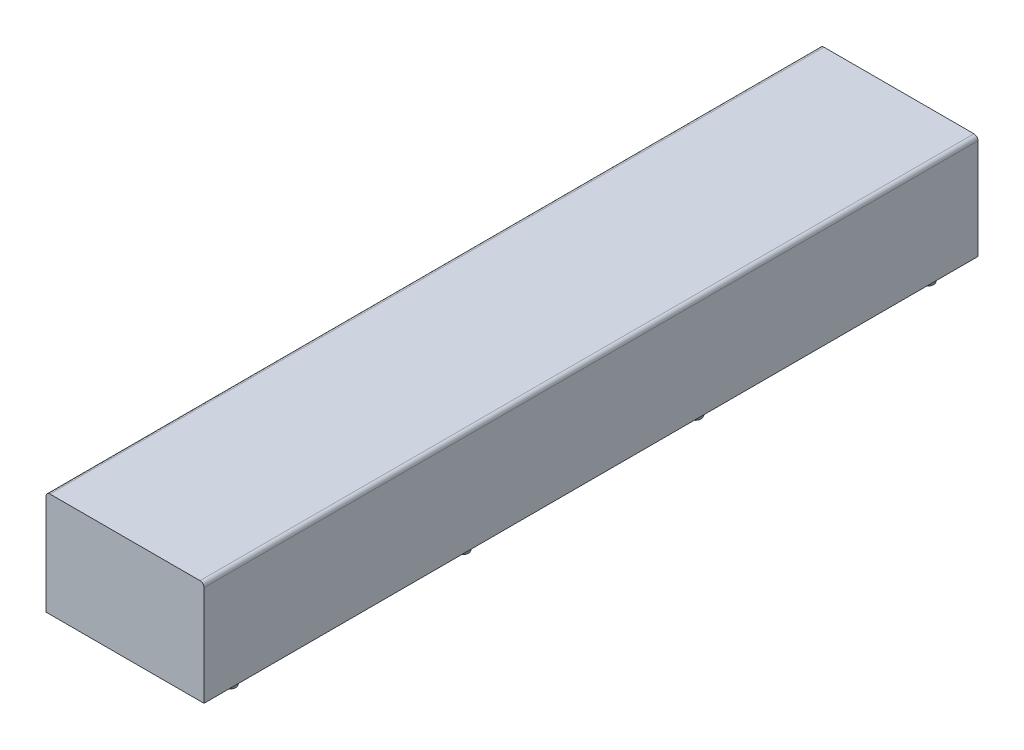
from build123d import *

# Parameters (mm, degrees)
EXTRUSION1_DEPTH           = 120
EXTRUSION1_DEPTH_BACK      = 845
ESQUISSE2_R                = 10
EXTRUSION2_DEPTH           = 10
EXTRUSION2_DRAFT           = 20
EXTRUSION2_PROFILE_2_DEPTH = 10
EXTRUSION2_PROFILE_2_DRAFT = 20
EXTRUSION2_PROFILE_3_DEPTH = 10
EXTRUSION2_PROFILE_3_DRAFT = 20
EXTRUSION2_PROFILE_4_DEPTH = 10
EXTRUSION2_PROFILE_4_DRAFT = 20
EXTRUSION2_PROFILE_5_DEPTH = 10
EXTRUSION2_PROFILE_5_DRAFT = 20
EXTRUSION2_PROFILE_6_DEPTH = 10
EXTRUSION2_PROFILE_6_DRAFT = 20
EXTRUSION2_PROFILE_7_DEPTH = 10
EXTRUSION2_PROFILE_7_DRAFT = 20
EXTRUSION2_PROFILE_8_DEPTH = 10
EXTRUSION2_PROFILE_8_DRAFT = 20


with BuildPart() as part:
    # Esquisse1 → Extrusion1 (new, two sides: drawn at the far end of the back side and taken through both)
    with BuildSketch(Plane.XY.offset(-EXTRUSION1_DEPTH_BACK)):
        with BuildLine():
            Line((-93.5, 0), (93.5, 0))
            ThreePointArc((93.5, 0), (97.035533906, -1.464466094), (98.5, -5))
            Line((98.5, -5), (98.5, -130))
            Line((98.5, -130), (-98.5, -130))
            Line((-98.5, -130), (-98.5, -5))
            ThreePointArc((-98.5, -5), (-97.035533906, -1.464466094), (-93.5, 0))
        make_face()
    extrude(amount=EXTRUSION1_DEPTH + EXTRUSION1_DEPTH_BACK)


with BuildPart() as body_2:
    # Esquisse2 → Extrusion2 (with draft: the straight prism first)
    with BuildSketch(Plane.XZ.offset(130)):
        with Locations((85, -796.817862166)):
            Circle(ESQUISSE2_R)
    extrude(amount=EXTRUSION2_DEPTH)
    # Extrusion2: the draft: its side faces are tilted about the plane it starts from
    extrusion2_sides = [body_2.faces().sort_by_distance(p)[0] for p in [
        (75, -135, -796.817862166),
    ]]
    draft(extrusion2_sides, Plane.XZ.offset(130), EXTRUSION2_DRAFT)


with BuildPart() as body_3:
    # Esquisse2 → Extrusion2 profile 2 (with draft: the straight prism first)
    with BuildSketch(Plane.XZ.offset(130)):
        with Locations((-85, -796.817862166)):
            Circle(ESQUISSE2_R)
    extrude(amount=EXTRUSION2_PROFILE_2_DEPTH)
    # Extrusion2 profile 2: the draft: its side faces are tilted about the plane it starts from
    extrusion2_profile_2_sides = [body_3.faces().sort_by_distance(p)[0] for p in [
        (-95, -135, -796.817862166),
    ]]
    draft(extrusion2_profile_2_sides, Plane.XZ.offset(130), EXTRUSION2_PROFILE_2_DRAFT)


with BuildPart() as body_4:
    # Esquisse2 → Extrusion2 profile 3 (with draft: the straight prism first)
    with BuildSketch(Plane.XZ.offset(130)):
        with Locations((85, -506.817862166)):
            Circle(ESQUISSE2_R)
    extrude(amount=EXTRUSION2_PROFILE_3_DEPTH)
    # Extrusion2 profile 3: the draft: its side faces are tilted about the plane it starts from
    extrusion2_profile_3_sides = [body_4.faces().sort_by_distance(p)[0] for p in [
        (75, -135, -506.817862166),
    ]]
    draft(extrusion2_profile_3_sides, Plane.XZ.offset(130), EXTRUSION2_PROFILE_3_DRAFT)


with BuildPart() as body_5:
    # Esquisse2 → Extrusion2 profile 4 (with draft: the straight prism first)
    with BuildSketch(Plane.XZ.offset(130)):
        with Locations((-85, -506.817862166)):
            Circle(ESQUISSE2_R)
    extrude(amount=EXTRUSION2_PROFILE_4_DEPTH)
    # Extrusion2 profile 4: the draft: its side faces are tilted about the plane it starts from
    extrusion2_profile_4_sides = [body_5.faces().sort_by_distance(p)[0] for p in [
        (-95, -135, -506.817862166),
    ]]
    draft(extrusion2_profile_4_sides, Plane.XZ.offset(130), EXTRUSION2_PROFILE_4_DRAFT)


with BuildPart() as body_6:
    # Esquisse2 → Extrusion2 profile 5 (with draft: the straight prism first)
    with BuildSketch(Plane.XZ.offset(130)):
        with Locations((85, -216.817862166)):
            Circle(ESQUISSE2_R)
    extrude(amount=EXTRUSION2_PROFILE_5_DEPTH)
    # Extrusion2 profile 5: the draft: its side faces are tilted about the plane it starts from
    extrusion2_profile_5_sides = [body_6.faces().sort_by_distance(p)[0] for p in [
        (75, -135, -216.817862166),
    ]]
    draft(extrusion2_profile_5_sides, Plane.XZ.offset(130), EXTRUSION2_PROFILE_5_DRAFT)


with BuildPart() as body_7:
    # Esquisse2 → Extrusion2 profile 6 (with draft: the straight prism first)
    with BuildSketch(Plane.XZ.offset(130)):
        with Locations((-85, -216.817862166)):
            Circle(ESQUISSE2_R)
    extrude(amount=EXTRUSION2_PROFILE_6_DEPTH)
    # Extrusion2 profile 6: the draft: its side faces are tilted about the plane it starts from
    extrusion2_profile_6_sides = [body_7.faces().sort_by_distance(p)[0] for p in [
        (-95, -135, -216.817862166),
    ]]
    draft(extrusion2_profile_6_sides, Plane.XZ.offset(130), EXTRUSION2_PROFILE_6_DRAFT)


with BuildPart() as body_8:
    # Esquisse2 → Extrusion2 profile 7 (with draft: the straight prism first)
    with BuildSketch(Plane.XZ.offset(130)):
        with Locations((85, 73.182137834)):
            Circle(ESQUISSE2_R)
    extrude(amount=EXTRUSION2_PROFILE_7_DEPTH)
    # Extrusion2 profile 7: the draft: its side faces are tilted about the plane it starts from
    extrusion2_profile_7_sides = [body_8.faces().sort_by_distance(p)[0] for p in [
        (75, -135, 73.182137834),
    ]]
    draft(extrusion2_profile_7_sides, Plane.XZ.offset(130), EXTRUSION2_PROFILE_7_DRAFT)


with BuildPart() as body_9:
    # Esquisse2 → Extrusion2 profile 8 (with draft: the straight prism first)
    with BuildSketch(Plane.XZ.offset(130)):
        with Locations((-85, 73.182137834)):
            Circle(ESQUISSE2_R)
    extrude(amount=EXTRUSION2_PROFILE_8_DEPTH)
    # Extrusion2 profile 8: the draft: its side faces are tilted about the plane it starts from
    extrusion2_profile_8_sides = [body_9.faces().sort_by_distance(p)[0] for p in [
        (-95, -135, 73.182137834),
    ]]
    draft(extrusion2_profile_8_sides, Plane.XZ.offset(130), EXTRUSION2_PROFILE_8_DRAFT)


solid = Compound([part.part, body_2.part, body_3.part, body_4.part, body_5.part, body_6.part, body_7.part, body_8.part, body_9.part])
